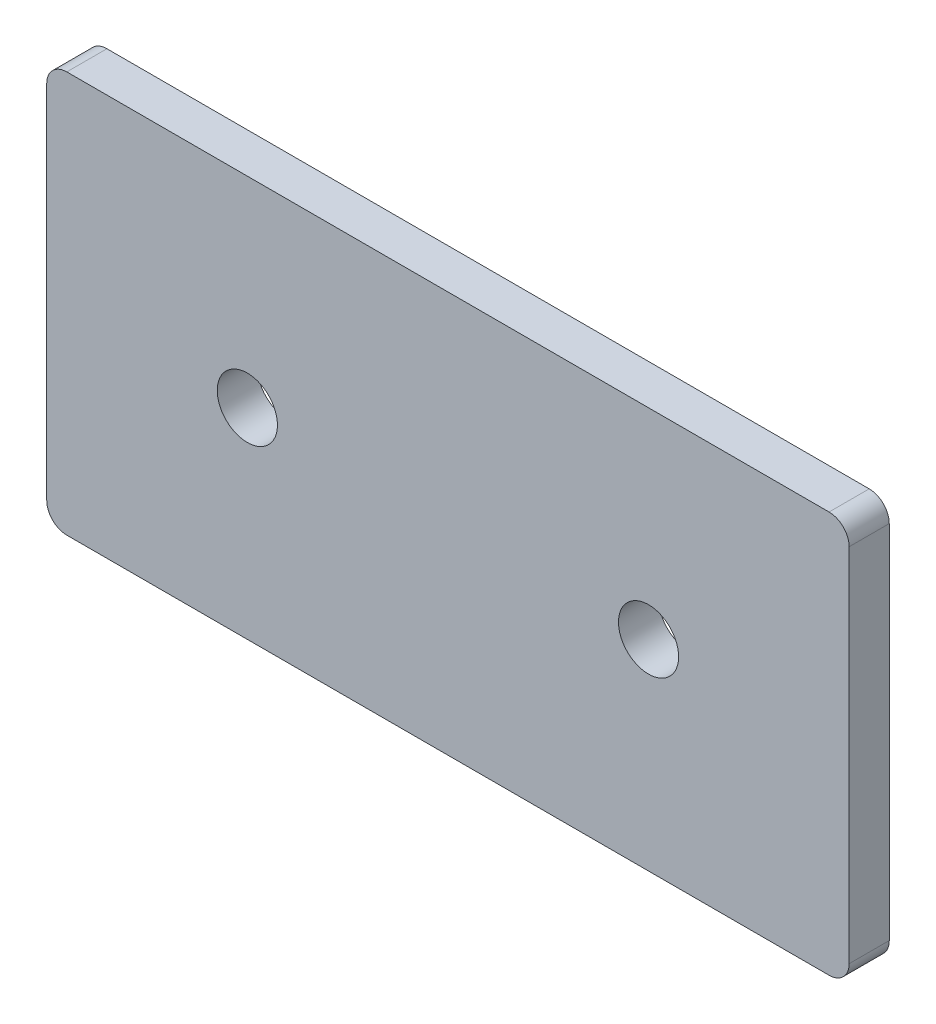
ISO-10303-21;
HEADER;
FILE_DESCRIPTION(('STEP AP214'),'2;1');
FILE_NAME('part.step','',(''),(''),'','','');
FILE_SCHEMA(('AUTOMOTIVE_DESIGN { 1 0 10303 214 1 1 1 1 }'));
ENDSEC;
DATA;
#1=APPLICATION_CONTEXT('core data for automotive mechanical design processes');
#2=APPLICATION_PROTOCOL_DEFINITION('international standard','automotive_design',2000,#1);
#3=PRODUCT_CONTEXT('',#1,'mechanical');
#4=PRODUCT('Part','Part','',(#3));
#5=PRODUCT_RELATED_PRODUCT_CATEGORY('part','',(#4));
#6=PRODUCT_DEFINITION_FORMATION('','',#4);
#7=PRODUCT_DEFINITION_CONTEXT('part definition',#1,'design');
#8=PRODUCT_DEFINITION('design','',#6,#7);
#9=PRODUCT_DEFINITION_SHAPE('','',#8);
#10=(LENGTH_UNIT() NAMED_UNIT(*) SI_UNIT(.MILLI.,.METRE.));
#11=(NAMED_UNIT(*) PLANE_ANGLE_UNIT() SI_UNIT($,.RADIAN.));
#12=(NAMED_UNIT(*) SI_UNIT($,.STERADIAN.) SOLID_ANGLE_UNIT());
#13=UNCERTAINTY_MEASURE_WITH_UNIT(LENGTH_MEASURE(1.E-05),#10,'distance_accuracy_value','');
#14=(GEOMETRIC_REPRESENTATION_CONTEXT(3) GLOBAL_UNCERTAINTY_ASSIGNED_CONTEXT((#13)) GLOBAL_UNIT_ASSIGNED_CONTEXT((#10,
#11,#12)) REPRESENTATION_CONTEXT('',''));
#15=CARTESIAN_POINT('',(0.,0.,0.));
#16=DIRECTION('',(0.,0.,1.));
#17=DIRECTION('',(1.,0.,0.));
#18=AXIS2_PLACEMENT_3D('',#15,#16,#17);
#19=CARTESIAN_POINT('',(78.,38.,4.));
#20=DIRECTION('',(0.,0.,-1.));
#21=DIRECTION('',(-1.,0.,0.));
#22=AXIS2_PLACEMENT_3D('',#19,#20,#21);
#23=CYLINDRICAL_SURFACE('',#22,2.);
#24=CARTESIAN_POINT('',(78.,38.,0.));
#25=DIRECTION('',(0.,0.,1.));
#26=DIRECTION('',(-1.,0.,0.));
#27=AXIS2_PLACEMENT_3D('',#24,#25,#26);
#28=CIRCLE('',#27,2.);
#29=CARTESIAN_POINT('',(80.,38.,0.));
#30=VERTEX_POINT('',#29);
#31=CARTESIAN_POINT('',(78.,40.,0.));
#32=VERTEX_POINT('',#31);
#33=EDGE_CURVE('E96',#30,#32,#28,.T.);
#34=ORIENTED_EDGE('',*,*,#33,.T.);
#35=DIRECTION('',(0.,0.,-1.));
#36=VECTOR('',#35,1.);
#37=CARTESIAN_POINT('',(78.,40.,4.));
#38=LINE('',#37,#36);
#39=CARTESIAN_POINT('',(78.,40.,4.));
#40=VERTEX_POINT('',#39);
#41=EDGE_CURVE('E11',#40,#32,#38,.T.);
#42=ORIENTED_EDGE('',*,*,#41,.F.);
#43=CARTESIAN_POINT('',(78.,38.,4.));
#44=DIRECTION('',(0.,0.,1.));
#45=DIRECTION('',(-1.,0.,0.));
#46=AXIS2_PLACEMENT_3D('',#43,#44,#45);
#47=CIRCLE('',#46,2.);
#48=CARTESIAN_POINT('',(80.,38.,4.));
#49=VERTEX_POINT('',#48);
#50=EDGE_CURVE('E128',#49,#40,#47,.T.);
#51=ORIENTED_EDGE('',*,*,#50,.F.);
#52=DIRECTION('',(0.,0.,-1.));
#53=VECTOR('',#52,1.);
#54=CARTESIAN_POINT('',(80.,38.,4.));
#55=LINE('',#54,#53);
#56=EDGE_CURVE('E109',#49,#30,#55,.T.);
#57=ORIENTED_EDGE('',*,*,#56,.T.);
#58=EDGE_LOOP('',(#34,#42,#51,#57));
#59=FACE_BOUND('',#58,.T.);
#60=ADVANCED_FACE('F28',(#59),#23,.T.);
#61=CARTESIAN_POINT('',(2.00000000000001,40.,4.));
#62=DIRECTION('',(0.,-1.,0.));
#63=DIRECTION('',(0.,0.,-1.));
#64=AXIS2_PLACEMENT_3D('',#61,#62,#63);
#65=PLANE('',#64);
#66=DIRECTION('',(-1.,0.,0.));
#67=VECTOR('',#66,1.);
#68=CARTESIAN_POINT('',(2.00000000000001,40.,0.));
#69=LINE('',#68,#67);
#70=CARTESIAN_POINT('',(2.00000000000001,40.,0.));
#71=VERTEX_POINT('',#70);
#72=EDGE_CURVE('E92',#32,#71,#69,.T.);
#73=ORIENTED_EDGE('',*,*,#72,.T.);
#74=DIRECTION('',(0.,0.,-1.));
#75=VECTOR('',#74,1.);
#76=CARTESIAN_POINT('',(2.00000000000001,40.,4.));
#77=LINE('',#76,#75);
#78=CARTESIAN_POINT('',(2.00000000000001,40.,4.));
#79=VERTEX_POINT('',#78);
#80=EDGE_CURVE('E35',#79,#71,#77,.T.);
#81=ORIENTED_EDGE('',*,*,#80,.F.);
#82=DIRECTION('',(-1.,0.,0.));
#83=VECTOR('',#82,1.);
#84=CARTESIAN_POINT('',(2.00000000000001,40.,4.));
#85=LINE('',#84,#83);
#86=EDGE_CURVE('E105',#40,#79,#85,.T.);
#87=ORIENTED_EDGE('',*,*,#86,.F.);
#88=ORIENTED_EDGE('',*,*,#41,.T.);
#89=EDGE_LOOP('',(#73,#81,#87,#88));
#90=FACE_BOUND('',#89,.T.);
#91=ADVANCED_FACE('F104',(#90),#65,.F.);
#92=CARTESIAN_POINT('',(2.,38.,4.));
#93=DIRECTION('',(0.,0.,-1.));
#94=DIRECTION('',(-1.,0.,0.));
#95=AXIS2_PLACEMENT_3D('',#92,#93,#94);
#96=CYLINDRICAL_SURFACE('',#95,2.);
#97=CARTESIAN_POINT('',(2.,38.,0.));
#98=DIRECTION('',(0.,0.,1.));
#99=DIRECTION('',(-1.,0.,0.));
#100=AXIS2_PLACEMENT_3D('',#97,#98,#99);
#101=CIRCLE('',#100,2.);
#102=CARTESIAN_POINT('',(0.,38.,0.));
#103=VERTEX_POINT('',#102);
#104=EDGE_CURVE('E98',#71,#103,#101,.T.);
#105=ORIENTED_EDGE('',*,*,#104,.T.);
#106=DIRECTION('',(0.,0.,-1.));
#107=VECTOR('',#106,1.);
#108=CARTESIAN_POINT('',(0.,38.,4.));
#109=LINE('',#108,#107);
#110=CARTESIAN_POINT('',(0.,38.,4.));
#111=VERTEX_POINT('',#110);
#112=EDGE_CURVE('E154',#111,#103,#109,.T.);
#113=ORIENTED_EDGE('',*,*,#112,.F.);
#114=CARTESIAN_POINT('',(2.,38.,4.));
#115=DIRECTION('',(0.,0.,1.));
#116=DIRECTION('',(-1.,0.,0.));
#117=AXIS2_PLACEMENT_3D('',#114,#115,#116);
#118=CIRCLE('',#117,2.);
#119=EDGE_CURVE('E131',#79,#111,#118,.T.);
#120=ORIENTED_EDGE('',*,*,#119,.F.);
#121=ORIENTED_EDGE('',*,*,#80,.T.);
#122=EDGE_LOOP('',(#105,#113,#120,#121));
#123=FACE_BOUND('',#122,.T.);
#124=ADVANCED_FACE('F158',(#123),#96,.T.);
#125=CARTESIAN_POINT('',(0.,2.00000000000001,4.));
#126=DIRECTION('',(1.,0.,0.));
#127=DIRECTION('',(0.,0.,-1.));
#128=AXIS2_PLACEMENT_3D('',#125,#126,#127);
#129=PLANE('',#128);
#130=DIRECTION('',(0.,-1.,0.));
#131=VECTOR('',#130,1.);
#132=CARTESIAN_POINT('',(0.,2.00000000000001,0.));
#133=LINE('',#132,#131);
#134=CARTESIAN_POINT('',(0.,2.00000000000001,0.));
#135=VERTEX_POINT('',#134);
#136=EDGE_CURVE('E118',#103,#135,#133,.T.);
#137=ORIENTED_EDGE('',*,*,#136,.T.);
#138=DIRECTION('',(0.,0.,-1.));
#139=VECTOR('',#138,1.);
#140=CARTESIAN_POINT('',(0.,2.00000000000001,4.));
#141=LINE('',#140,#139);
#142=CARTESIAN_POINT('',(0.,2.00000000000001,4.));
#143=VERTEX_POINT('',#142);
#144=EDGE_CURVE('E151',#143,#135,#141,.T.);
#145=ORIENTED_EDGE('',*,*,#144,.F.);
#146=DIRECTION('',(0.,-1.,0.));
#147=VECTOR('',#146,1.);
#148=CARTESIAN_POINT('',(0.,2.00000000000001,4.));
#149=LINE('',#148,#147);
#150=EDGE_CURVE('E133',#111,#143,#149,.T.);
#151=ORIENTED_EDGE('',*,*,#150,.F.);
#152=ORIENTED_EDGE('',*,*,#112,.T.);
#153=EDGE_LOOP('',(#137,#145,#151,#152));
#154=FACE_BOUND('',#153,.T.);
#155=ADVANCED_FACE('F166',(#154),#129,.F.);
#156=CARTESIAN_POINT('',(2.,2.,4.));
#157=DIRECTION('',(0.,0.,-1.));
#158=DIRECTION('',(-1.,0.,0.));
#159=AXIS2_PLACEMENT_3D('',#156,#157,#158);
#160=CYLINDRICAL_SURFACE('',#159,2.);
#161=CARTESIAN_POINT('',(2.,2.,0.));
#162=DIRECTION('',(0.,0.,1.));
#163=DIRECTION('',(-1.,0.,0.));
#164=AXIS2_PLACEMENT_3D('',#161,#162,#163);
#165=CIRCLE('',#164,2.);
#166=CARTESIAN_POINT('',(2.00000000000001,0.,0.));
#167=VERTEX_POINT('',#166);
#168=EDGE_CURVE('E120',#135,#167,#165,.T.);
#169=ORIENTED_EDGE('',*,*,#168,.T.);
#170=DIRECTION('',(0.,0.,-1.));
#171=VECTOR('',#170,1.);
#172=CARTESIAN_POINT('',(2.00000000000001,0.,4.));
#173=LINE('',#172,#171);
#174=CARTESIAN_POINT('',(2.00000000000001,0.,4.));
#175=VERTEX_POINT('',#174);
#176=EDGE_CURVE('E148',#175,#167,#173,.T.);
#177=ORIENTED_EDGE('',*,*,#176,.F.);
#178=CARTESIAN_POINT('',(2.,2.,4.));
#179=DIRECTION('',(0.,0.,1.));
#180=DIRECTION('',(-1.,0.,0.));
#181=AXIS2_PLACEMENT_3D('',#178,#179,#180);
#182=CIRCLE('',#181,2.);
#183=EDGE_CURVE('E135',#143,#175,#182,.T.);
#184=ORIENTED_EDGE('',*,*,#183,.F.);
#185=ORIENTED_EDGE('',*,*,#144,.T.);
#186=EDGE_LOOP('',(#169,#177,#184,#185));
#187=FACE_BOUND('',#186,.T.);
#188=ADVANCED_FACE('F169',(#187),#160,.T.);
#189=CARTESIAN_POINT('',(2.00000000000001,0.,4.));
#190=DIRECTION('',(0.,1.,0.));
#191=DIRECTION('',(0.,0.,1.));
#192=AXIS2_PLACEMENT_3D('',#189,#190,#191);
#193=PLANE('',#192);
#194=DIRECTION('',(1.,0.,0.));
#195=VECTOR('',#194,1.);
#196=CARTESIAN_POINT('',(2.00000000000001,0.,0.));
#197=LINE('',#196,#195);
#198=CARTESIAN_POINT('',(78.,0.,0.));
#199=VERTEX_POINT('',#198);
#200=EDGE_CURVE('E122',#167,#199,#197,.T.);
#201=ORIENTED_EDGE('',*,*,#200,.T.);
#202=DIRECTION('',(0.,0.,-1.));
#203=VECTOR('',#202,1.);
#204=CARTESIAN_POINT('',(78.,0.,4.));
#205=LINE('',#204,#203);
#206=CARTESIAN_POINT('',(78.,0.,4.));
#207=VERTEX_POINT('',#206);
#208=EDGE_CURVE('E145',#207,#199,#205,.T.);
#209=ORIENTED_EDGE('',*,*,#208,.F.);
#210=DIRECTION('',(1.,0.,0.));
#211=VECTOR('',#210,1.);
#212=CARTESIAN_POINT('',(2.00000000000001,0.,4.));
#213=LINE('',#212,#211);
#214=EDGE_CURVE('E137',#175,#207,#213,.T.);
#215=ORIENTED_EDGE('',*,*,#214,.F.);
#216=ORIENTED_EDGE('',*,*,#176,.T.);
#217=EDGE_LOOP('',(#201,#209,#215,#216));
#218=FACE_BOUND('',#217,.T.);
#219=ADVANCED_FACE('F174',(#218),#193,.F.);
#220=CARTESIAN_POINT('',(78.,2.,4.));
#221=DIRECTION('',(0.,0.,-1.));
#222=DIRECTION('',(-1.,0.,0.));
#223=AXIS2_PLACEMENT_3D('',#220,#221,#222);
#224=CYLINDRICAL_SURFACE('',#223,2.);
#225=CARTESIAN_POINT('',(78.,2.,0.));
#226=DIRECTION('',(0.,0.,1.));
#227=DIRECTION('',(-1.,0.,0.));
#228=AXIS2_PLACEMENT_3D('',#225,#226,#227);
#229=CIRCLE('',#228,2.);
#230=CARTESIAN_POINT('',(80.,2.00000000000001,0.));
#231=VERTEX_POINT('',#230);
#232=EDGE_CURVE('E124',#199,#231,#229,.T.);
#233=ORIENTED_EDGE('',*,*,#232,.T.);
#234=DIRECTION('',(0.,0.,-1.));
#235=VECTOR('',#234,1.);
#236=CARTESIAN_POINT('',(80.,2.00000000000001,4.));
#237=LINE('',#236,#235);
#238=CARTESIAN_POINT('',(80.,2.00000000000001,4.));
#239=VERTEX_POINT('',#238);
#240=EDGE_CURVE('E142',#239,#231,#237,.T.);
#241=ORIENTED_EDGE('',*,*,#240,.F.);
#242=CARTESIAN_POINT('',(78.,2.,4.));
#243=DIRECTION('',(0.,0.,1.));
#244=DIRECTION('',(-1.,0.,0.));
#245=AXIS2_PLACEMENT_3D('',#242,#243,#244);
#246=CIRCLE('',#245,2.);
#247=EDGE_CURVE('E47',#207,#239,#246,.T.);
#248=ORIENTED_EDGE('',*,*,#247,.F.);
#249=ORIENTED_EDGE('',*,*,#208,.T.);
#250=EDGE_LOOP('',(#233,#241,#248,#249));
#251=FACE_BOUND('',#250,.T.);
#252=ADVANCED_FACE('F177',(#251),#224,.T.);
#253=CARTESIAN_POINT('',(80.,2.00000000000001,4.));
#254=DIRECTION('',(-1.,0.,0.));
#255=DIRECTION('',(0.,0.,1.));
#256=AXIS2_PLACEMENT_3D('',#253,#254,#255);
#257=PLANE('',#256);
#258=DIRECTION('',(0.,1.,0.));
#259=VECTOR('',#258,1.);
#260=CARTESIAN_POINT('',(80.,2.00000000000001,0.));
#261=LINE('',#260,#259);
#262=EDGE_CURVE('E126',#231,#30,#261,.T.);
#263=ORIENTED_EDGE('',*,*,#262,.T.);
#264=ORIENTED_EDGE('',*,*,#56,.F.);
#265=DIRECTION('',(0.,1.,0.));
#266=VECTOR('',#265,1.);
#267=CARTESIAN_POINT('',(80.,2.00000000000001,4.));
#268=LINE('',#267,#266);
#269=EDGE_CURVE('E42',#239,#49,#268,.T.);
#270=ORIENTED_EDGE('',*,*,#269,.F.);
#271=ORIENTED_EDGE('',*,*,#240,.T.);
#272=EDGE_LOOP('',(#263,#264,#270,#271));
#273=FACE_BOUND('',#272,.T.);
#274=ADVANCED_FACE('F179',(#273),#257,.F.);
#275=CARTESIAN_POINT('',(78.,38.,4.));
#276=DIRECTION('',(0.,0.,-1.));
#277=DIRECTION('',(-1.,0.,0.));
#278=AXIS2_PLACEMENT_3D('',#275,#276,#277);
#279=PLANE('',#278);
#280=CARTESIAN_POINT('',(20.,20.,4.));
#281=DIRECTION('',(0.,0.,1.));
#282=DIRECTION('',(1.,0.,0.));
#283=AXIS2_PLACEMENT_3D('',#280,#281,#282);
#284=CIRCLE('',#283,3.);
#285=CARTESIAN_POINT('',(23.,20.,4.));
#286=VERTEX_POINT('',#285);
#287=EDGE_CURVE('E260',#286,#286,#284,.T.);
#288=ORIENTED_EDGE('',*,*,#287,.F.);
#289=EDGE_LOOP('',(#288));
#290=FACE_BOUND('',#289,.T.);
#291=CARTESIAN_POINT('',(60.,20.,4.));
#292=DIRECTION('',(0.,0.,1.));
#293=DIRECTION('',(1.,0.,0.));
#294=AXIS2_PLACEMENT_3D('',#291,#292,#293);
#295=CIRCLE('',#294,3.00000000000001);
#296=CARTESIAN_POINT('',(63.,20.,4.));
#297=VERTEX_POINT('',#296);
#298=EDGE_CURVE('E113',#297,#297,#295,.T.);
#299=ORIENTED_EDGE('',*,*,#298,.F.);
#300=EDGE_LOOP('',(#299));
#301=FACE_BOUND('',#300,.T.);
#302=ORIENTED_EDGE('',*,*,#50,.T.);
#303=ORIENTED_EDGE('',*,*,#86,.T.);
#304=ORIENTED_EDGE('',*,*,#119,.T.);
#305=ORIENTED_EDGE('',*,*,#150,.T.);
#306=ORIENTED_EDGE('',*,*,#183,.T.);
#307=ORIENTED_EDGE('',*,*,#214,.T.);
#308=ORIENTED_EDGE('',*,*,#247,.T.);
#309=ORIENTED_EDGE('',*,*,#269,.T.);
#310=EDGE_LOOP('',(#302,#303,#304,#305,#306,#307,#308,#309));
#311=FACE_BOUND('',#310,.T.);
#312=ADVANCED_FACE('F161',(#290,#301,#311),#279,.F.);
#313=CARTESIAN_POINT('',(78.,38.,0.));
#314=DIRECTION('',(0.,0.,-1.));
#315=DIRECTION('',(-1.,0.,0.));
#316=AXIS2_PLACEMENT_3D('',#313,#314,#315);
#317=PLANE('',#316);
#318=CARTESIAN_POINT('',(20.,20.,0.));
#319=DIRECTION('',(0.,0.,1.));
#320=DIRECTION('',(1.,0.,0.));
#321=AXIS2_PLACEMENT_3D('',#318,#319,#320);
#322=CIRCLE('',#321,3.);
#323=CARTESIAN_POINT('',(23.,20.,0.));
#324=VERTEX_POINT('',#323);
#325=EDGE_CURVE('E257',#324,#324,#322,.T.);
#326=ORIENTED_EDGE('',*,*,#325,.T.);
#327=EDGE_LOOP('',(#326));
#328=FACE_BOUND('',#327,.T.);
#329=CARTESIAN_POINT('',(60.,20.,0.));
#330=DIRECTION('',(0.,0.,1.));
#331=DIRECTION('',(1.,0.,0.));
#332=AXIS2_PLACEMENT_3D('',#329,#330,#331);
#333=CIRCLE('',#332,3.00000000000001);
#334=CARTESIAN_POINT('',(63.,20.,0.));
#335=VERTEX_POINT('',#334);
#336=EDGE_CURVE('E110',#335,#335,#333,.T.);
#337=ORIENTED_EDGE('',*,*,#336,.T.);
#338=EDGE_LOOP('',(#337));
#339=FACE_BOUND('',#338,.T.);
#340=ORIENTED_EDGE('',*,*,#33,.F.);
#341=ORIENTED_EDGE('',*,*,#262,.F.);
#342=ORIENTED_EDGE('',*,*,#232,.F.);
#343=ORIENTED_EDGE('',*,*,#200,.F.);
#344=ORIENTED_EDGE('',*,*,#168,.F.);
#345=ORIENTED_EDGE('',*,*,#136,.F.);
#346=ORIENTED_EDGE('',*,*,#104,.F.);
#347=ORIENTED_EDGE('',*,*,#72,.F.);
#348=EDGE_LOOP('',(#340,#341,#342,#343,#344,#345,#346,#347));
#349=FACE_BOUND('',#348,.T.);
#350=ADVANCED_FACE('F93',(#328,#339,#349),#317,.T.);
#351=CARTESIAN_POINT('',(60.,20.,0.));
#352=DIRECTION('',(0.,0.,1.));
#353=DIRECTION('',(1.,0.,0.));
#354=AXIS2_PLACEMENT_3D('',#351,#352,#353);
#355=CYLINDRICAL_SURFACE('',#354,3.00000000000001);
#356=ORIENTED_EDGE('',*,*,#336,.F.);
#357=EDGE_LOOP('',(#356));
#358=FACE_BOUND('',#357,.T.);
#359=ORIENTED_EDGE('',*,*,#298,.T.);
#360=EDGE_LOOP('',(#359));
#361=FACE_BOUND('',#360,.T.);
#362=ADVANCED_FACE('F230',(#358,#361),#355,.F.);
#363=CARTESIAN_POINT('',(20.,20.,0.));
#364=DIRECTION('',(0.,0.,1.));
#365=DIRECTION('',(1.,0.,0.));
#366=AXIS2_PLACEMENT_3D('',#363,#364,#365);
#367=CYLINDRICAL_SURFACE('',#366,3.);
#368=ORIENTED_EDGE('',*,*,#325,.F.);
#369=EDGE_LOOP('',(#368));
#370=FACE_BOUND('',#369,.T.);
#371=ORIENTED_EDGE('',*,*,#287,.T.);
#372=EDGE_LOOP('',(#371));
#373=FACE_BOUND('',#372,.T.);
#374=ADVANCED_FACE('F240',(#370,#373),#367,.F.);
#375=CLOSED_SHELL('',(#60,#91,#124,#155,#188,#219,#252,#274,#312,#350,#362,#374));
#376=MANIFOLD_SOLID_BREP('B2',#375);
#377=ADVANCED_BREP_SHAPE_REPRESENTATION('',(#18,#376),#14);
#378=SHAPE_DEFINITION_REPRESENTATION(#9,#377);
ENDSEC;
END-ISO-10303-21;
